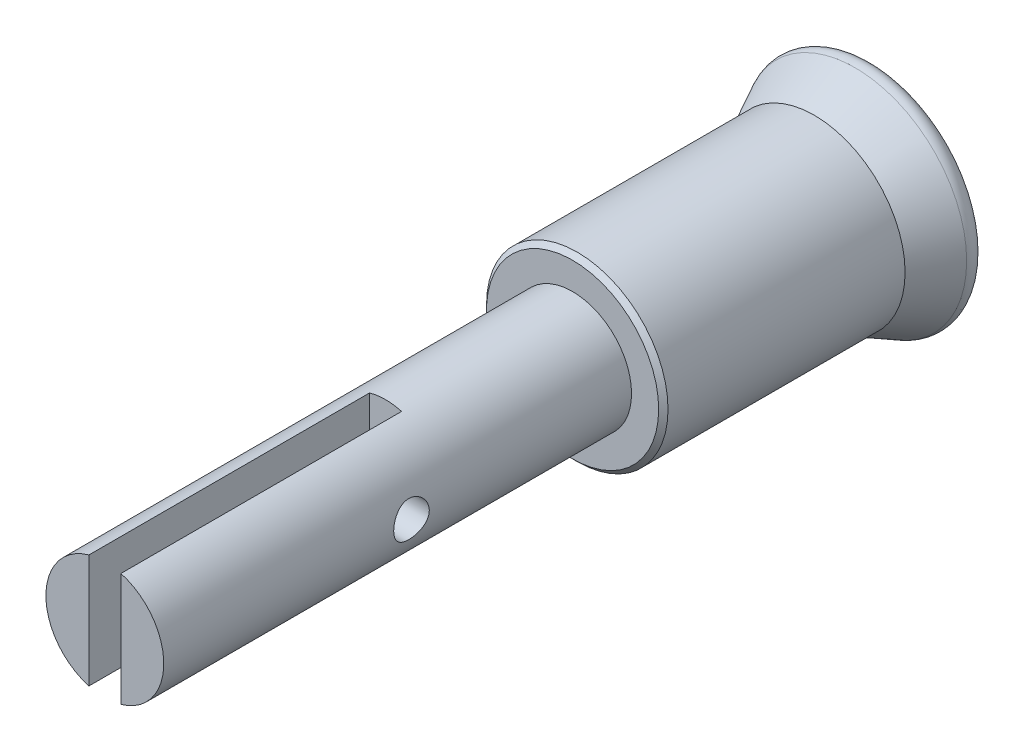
ISO-10303-21;
HEADER;
FILE_DESCRIPTION(('STEP AP214'),'2;1');
FILE_NAME('part.step','',(''),(''),'','','');
FILE_SCHEMA(('AUTOMOTIVE_DESIGN { 1 0 10303 214 1 1 1 1 }'));
ENDSEC;
DATA;
#1=APPLICATION_CONTEXT('core data for automotive mechanical design processes');
#2=APPLICATION_PROTOCOL_DEFINITION('international standard','automotive_design',2000,#1);
#3=PRODUCT_CONTEXT('',#1,'mechanical');
#4=PRODUCT('Part','Part','',(#3));
#5=PRODUCT_RELATED_PRODUCT_CATEGORY('part','',(#4));
#6=PRODUCT_DEFINITION_FORMATION('','',#4);
#7=PRODUCT_DEFINITION_CONTEXT('part definition',#1,'design');
#8=PRODUCT_DEFINITION('design','',#6,#7);
#9=PRODUCT_DEFINITION_SHAPE('','',#8);
#10=(LENGTH_UNIT() NAMED_UNIT(*) SI_UNIT(.MILLI.,.METRE.));
#11=(NAMED_UNIT(*) PLANE_ANGLE_UNIT() SI_UNIT($,.RADIAN.));
#12=(NAMED_UNIT(*) SI_UNIT($,.STERADIAN.) SOLID_ANGLE_UNIT());
#13=UNCERTAINTY_MEASURE_WITH_UNIT(LENGTH_MEASURE(1.E-05),#10,'distance_accuracy_value','');
#14=(GEOMETRIC_REPRESENTATION_CONTEXT(3) GLOBAL_UNCERTAINTY_ASSIGNED_CONTEXT((#13)) GLOBAL_UNIT_ASSIGNED_CONTEXT((#10,
#11,#12)) REPRESENTATION_CONTEXT('',''));
#15=CARTESIAN_POINT('',(0.,0.,0.));
#16=DIRECTION('',(0.,0.,1.));
#17=DIRECTION('',(1.,0.,0.));
#18=AXIS2_PLACEMENT_3D('',#15,#16,#17);
#19=CARTESIAN_POINT('',(0.,0.,20.32));
#20=DIRECTION('',(0.,0.,-1.));
#21=DIRECTION('',(-1.,0.,0.));
#22=AXIS2_PLACEMENT_3D('',#19,#20,#21);
#23=CONICAL_SURFACE('',#22,5.84199999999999,0.785398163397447);
#24=CARTESIAN_POINT('',(0.,0.,20.32));
#25=DIRECTION('',(0.,0.,1.));
#26=DIRECTION('',(1.,0.,0.));
#27=AXIS2_PLACEMENT_3D('',#24,#25,#26);
#28=CIRCLE('',#27,5.84199999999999);
#29=CARTESIAN_POINT('',(5.84199999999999,0.,20.32));
#30=VERTEX_POINT('',#29);
#31=EDGE_CURVE('E43',#30,#30,#28,.T.);
#32=ORIENTED_EDGE('',*,*,#31,.F.);
#33=EDGE_LOOP('',(#32));
#34=FACE_BOUND('',#33,.T.);
#35=CARTESIAN_POINT('',(0.,0.,20.0025));
#36=DIRECTION('',(0.,0.,-1.));
#37=DIRECTION('',(-1.,0.,0.));
#38=AXIS2_PLACEMENT_3D('',#35,#36,#37);
#39=CIRCLE('',#38,6.1595);
#40=CARTESIAN_POINT('',(6.1595,0.,20.0025));
#41=VERTEX_POINT('',#40);
#42=EDGE_CURVE('E112',#41,#41,#39,.F.);
#43=ORIENTED_EDGE('',*,*,#42,.T.);
#44=EDGE_LOOP('',(#43));
#45=FACE_BOUND('',#44,.T.);
#46=ADVANCED_FACE('F36',(#34,#45),#23,.T.);
#47=CARTESIAN_POINT('',(0.,0.,52.07));
#48=DIRECTION('',(0.,0.,1.));
#49=DIRECTION('',(1.,0.,0.));
#50=AXIS2_PLACEMENT_3D('',#47,#48,#49);
#51=PLANE('',#50);
#52=DIRECTION('',(0.,1.,0.));
#53=VECTOR('',#52,1.);
#54=CARTESIAN_POINT('',(1.0922,0.,52.07));
#55=LINE('',#54,#53);
#56=CARTESIAN_POINT('',(1.0922,-3.84851911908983,52.07));
#57=VERTEX_POINT('',#56);
#58=CARTESIAN_POINT('',(1.0922,3.84851911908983,52.07));
#59=VERTEX_POINT('',#58);
#60=EDGE_CURVE('E83',#57,#59,#55,.T.);
#61=ORIENTED_EDGE('',*,*,#60,.F.);
#62=CARTESIAN_POINT('',(0.,0.,52.07));
#63=DIRECTION('',(0.,0.,1.));
#64=DIRECTION('',(1.,0.,0.));
#65=AXIS2_PLACEMENT_3D('',#62,#63,#64);
#66=CIRCLE('',#65,4.0005);
#67=EDGE_CURVE('E96',#57,#59,#66,.T.);
#68=ORIENTED_EDGE('',*,*,#67,.T.);
#69=EDGE_LOOP('',(#61,#68));
#70=FACE_BOUND('',#69,.T.);
#71=ADVANCED_FACE('F158',(#70),#51,.T.);
#72=CARTESIAN_POINT('',(0.,0.,20.32));
#73=DIRECTION('',(0.,0.,1.));
#74=DIRECTION('',(1.,0.,0.));
#75=AXIS2_PLACEMENT_3D('',#72,#73,#74);
#76=PLANE('',#75);
#77=ORIENTED_EDGE('',*,*,#31,.T.);
#78=EDGE_LOOP('',(#77));
#79=FACE_BOUND('',#78,.T.);
#80=CARTESIAN_POINT('',(0.,0.,20.32));
#81=DIRECTION('',(0.,0.,1.));
#82=DIRECTION('',(1.,0.,0.));
#83=AXIS2_PLACEMENT_3D('',#80,#81,#82);
#84=CIRCLE('',#83,4.0005);
#85=CARTESIAN_POINT('',(4.0005,0.,20.32));
#86=VERTEX_POINT('',#85);
#87=EDGE_CURVE('E99',#86,#86,#84,.T.);
#88=ORIENTED_EDGE('',*,*,#87,.F.);
#89=EDGE_LOOP('',(#88));
#90=FACE_BOUND('',#89,.T.);
#91=ADVANCED_FACE('F162',(#79,#90),#76,.T.);
#92=CARTESIAN_POINT('',(0.,0.,52.07));
#93=DIRECTION('',(0.,0.,-1.));
#94=DIRECTION('',(-1.,0.,0.));
#95=AXIS2_PLACEMENT_3D('',#92,#93,#94);
#96=CYLINDRICAL_SURFACE('',#95,4.0005);
#97=CARTESIAN_POINT('',(-4.0005,0.,36.4620643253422));
#98=CARTESIAN_POINT('',(-4.00049945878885,-0.0661712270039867,36.4620635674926));
#99=CARTESIAN_POINT('',(-3.99884254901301,-0.13235012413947,36.4566024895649));
#100=CARTESIAN_POINT('',(-3.99239474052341,-0.262779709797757,36.4349549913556));
#101=CARTESIAN_POINT('',(-3.98760293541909,-0.327029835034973,36.4187654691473));
#102=CARTESIAN_POINT('',(-3.97541018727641,-0.451701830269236,36.3762515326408));
#103=CARTESIAN_POINT('',(-3.96801311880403,-0.512129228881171,36.3499421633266));
#104=CARTESIAN_POINT('',(-3.95137804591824,-0.627714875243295,36.2879973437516));
#105=CARTESIAN_POINT('',(-3.94213979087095,-0.68287240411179,36.2523606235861));
#106=CARTESIAN_POINT('',(-3.92250773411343,-0.787951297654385,36.1716845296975));
#107=CARTESIAN_POINT('',(-3.912090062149,-0.837698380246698,36.1264239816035));
#108=CARTESIAN_POINT('',(-3.89141518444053,-0.929023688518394,36.0282563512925));
#109=CARTESIAN_POINT('',(-3.88115800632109,-0.970600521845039,35.975347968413));
#110=CARTESIAN_POINT('',(-3.86171247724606,-1.04532572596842,35.8619076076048));
#111=CARTESIAN_POINT('',(-3.8525537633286,-1.07826074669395,35.8012295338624));
#112=CARTESIAN_POINT('',(-3.83669918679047,-1.1333879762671,35.6748752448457));
#113=CARTESIAN_POINT('',(-3.83000272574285,-1.15558279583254,35.609200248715));
#114=CARTESIAN_POINT('',(-3.82007972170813,-1.18796998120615,35.4766746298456));
#115=CARTESIAN_POINT('',(-3.81676044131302,-1.19848389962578,35.4099097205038));
#116=CARTESIAN_POINT('',(-3.8136918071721,-1.20821497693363,35.2754874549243));
#117=CARTESIAN_POINT('',(-3.81394157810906,-1.20743490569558,35.2078303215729));
#118=CARTESIAN_POINT('',(-3.8179006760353,-1.19485257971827,35.0761646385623));
#119=CARTESIAN_POINT('',(-3.82148332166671,-1.18345391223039,35.0121130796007));
#120=CARTESIAN_POINT('',(-3.83149944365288,-1.1506103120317,34.8868773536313));
#121=CARTESIAN_POINT('',(-3.83793320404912,-1.1291643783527,34.825693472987));
#122=CARTESIAN_POINT('',(-3.85302722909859,-1.07653928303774,34.7069459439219));
#123=CARTESIAN_POINT('',(-3.861717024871,-1.04522975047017,34.6494439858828));
#124=CARTESIAN_POINT('',(-3.88032988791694,-0.973856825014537,34.5403753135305));
#125=CARTESIAN_POINT('',(-3.89025325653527,-0.933791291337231,34.4888100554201));
#126=CARTESIAN_POINT('',(-3.910728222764,-0.844042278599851,34.3907903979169));
#127=CARTESIAN_POINT('',(-3.92128865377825,-0.794024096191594,34.3446437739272));
#128=CARTESIAN_POINT('',(-3.94147673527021,-0.686827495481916,34.2613214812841));
#129=CARTESIAN_POINT('',(-3.95110432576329,-0.629648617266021,34.2241463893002));
#130=CARTESIAN_POINT('',(-3.96843148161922,-0.509190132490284,34.1596328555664));
#131=CARTESIAN_POINT('',(-3.97611742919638,-0.445871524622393,34.1323633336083));
#132=CARTESIAN_POINT('',(-3.98859714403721,-0.315261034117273,34.0889517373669));
#133=CARTESIAN_POINT('',(-3.99339172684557,-0.247970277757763,34.0728065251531));
#134=CARTESIAN_POINT('',(-3.99941922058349,-0.113941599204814,34.0526157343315));
#135=CARTESIAN_POINT('',(-4.00077484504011,-0.0472719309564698,34.0481530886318));
#136=CARTESIAN_POINT('',(-4.00013206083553,0.085868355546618,34.0502842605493));
#137=CARTESIAN_POINT('',(-3.99813410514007,0.152338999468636,34.0568765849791));
#138=CARTESIAN_POINT('',(-3.99108902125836,0.281615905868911,34.0805936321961));
#139=CARTESIAN_POINT('',(-3.9861126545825,0.344471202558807,34.0974740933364));
#140=CARTESIAN_POINT('',(-3.97368751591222,0.466443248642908,34.1409938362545));
#141=CARTESIAN_POINT('',(-3.96623844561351,0.525559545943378,34.1676342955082));
#142=CARTESIAN_POINT('',(-3.94942284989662,0.639905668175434,34.2306143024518));
#143=CARTESIAN_POINT('',(-3.94001569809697,0.695012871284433,34.2671653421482));
#144=CARTESIAN_POINT('',(-3.92036341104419,0.798453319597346,34.348672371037));
#145=CARTESIAN_POINT('',(-3.9101180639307,0.846784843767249,34.393630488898));
#146=CARTESIAN_POINT('',(-3.88947222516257,0.937142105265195,34.4926352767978));
#147=CARTESIAN_POINT('',(-3.87907985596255,0.978871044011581,34.5469551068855));
#148=CARTESIAN_POINT('',(-3.85971542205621,1.05264283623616,34.6620520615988));
#149=CARTESIAN_POINT('',(-3.85074332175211,1.0846859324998,34.7228290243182));
#150=CARTESIAN_POINT('',(-3.83533814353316,1.13795949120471,34.8489293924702));
#151=CARTESIAN_POINT('',(-3.82889349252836,1.15923937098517,34.9142304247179));
#152=CARTESIAN_POINT('',(-3.81931078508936,1.19043557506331,35.0477200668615));
#153=CARTESIAN_POINT('',(-3.81617158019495,1.20035584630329,35.1159076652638));
#154=CARTESIAN_POINT('',(-3.81366916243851,1.20828098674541,35.2501491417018));
#155=CARTESIAN_POINT('',(-3.81415249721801,1.20677006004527,35.3161719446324));
#156=CARTESIAN_POINT('',(-3.81847127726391,1.19303312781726,35.4469758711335));
#157=CARTESIAN_POINT('',(-3.8223065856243,1.18080755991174,35.5117570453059));
#158=CARTESIAN_POINT('',(-3.83279369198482,1.14630243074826,35.6374380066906));
#159=CARTESIAN_POINT('',(-3.83940914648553,1.12415236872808,35.6983766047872));
#160=CARTESIAN_POINT('',(-3.85470413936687,1.07052796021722,35.815721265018));
#161=CARTESIAN_POINT('',(-3.86338407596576,1.03905181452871,35.8721264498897));
#162=CARTESIAN_POINT('',(-3.88222833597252,0.966313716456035,35.9810467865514));
#163=CARTESIAN_POINT('',(-3.89243550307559,0.924734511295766,36.033342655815));
#164=CARTESIAN_POINT('',(-3.91297747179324,0.833540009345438,36.130371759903));
#165=CARTESIAN_POINT('',(-3.92331230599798,0.783922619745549,36.1751030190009));
#166=CARTESIAN_POINT('',(-3.94331259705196,0.676288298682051,36.2570558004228));
#167=CARTESIAN_POINT('',(-3.95294911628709,0.618065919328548,36.2940152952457));
#168=CARTESIAN_POINT('',(-3.97011752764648,0.495943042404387,36.3575696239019));
#169=CARTESIAN_POINT('',(-3.97765038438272,0.43204516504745,36.384169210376));
#170=CARTESIAN_POINT('',(-3.9891216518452,0.307272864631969,36.4239203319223));
#171=CARTESIAN_POINT('',(-3.99335305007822,0.246778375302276,36.4381852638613));
#172=CARTESIAN_POINT('',(-3.99904224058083,0.124191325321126,36.4572568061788));
#173=CARTESIAN_POINT('',(-4.00050050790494,0.0620990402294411,36.4620650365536));
#174=CARTESIAN_POINT('',(-4.0005,0.,36.4620643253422));
#175=B_SPLINE_CURVE_WITH_KNOTS('',3,(#97,#98,#99,#100,#101,#102,#103,#104,#105,#106,#107,#108,
#109,#110,#111,#112,#113,#114,#115,#116,#117,#118,#119,#120,#121,#122,#123,#124,#125,#126,#127,
#128,#129,#130,#131,#132,#133,#134,#135,#136,#137,#138,#139,#140,#141,#142,#143,#144,#145,#146,
#147,#148,#149,#150,#151,#152,#153,#154,#155,#156,#157,#158,#159,#160,#161,#162,#163,#164,#165,
#166,#167,#168,#169,#170,#171,#172,#173,#174),.UNSPECIFIED.,.T.,.F.,(4,2,2,2,2,2,2,2,2,2,2,2,2,
2,2,2,2,2,2,2,2,2,2,2,2,2,2,2,2,2,2,2,2,2,2,2,2,2,4),(0.,0.198285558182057,0.396628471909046,
0.594677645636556,0.792753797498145,0.996000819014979,1.19928244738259,1.40719038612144,
1.61504776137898,1.81702937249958,2.01896144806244,2.21351865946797,2.40809525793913,
2.6053599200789,2.80267286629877,3.00831799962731,3.21397634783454,3.42103936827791,
3.6280439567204,3.82755085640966,4.02703081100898,4.22194980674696,4.41689232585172,
4.61637622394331,4.81591069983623,5.02277373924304,5.22963159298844,5.43553087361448,
5.64135859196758,5.83851820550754,6.03566976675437,6.23032051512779,6.42500884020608,
6.62685547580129,6.82875474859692,7.03664112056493,7.24443201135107,7.4305469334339,
7.6166299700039),.UNSPECIFIED.);
#176=CARTESIAN_POINT('',(-4.0005,0.,36.4620643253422));
#177=VERTEX_POINT('',#176);
#178=EDGE_CURVE('E119',#177,#177,#175,.T.);
#179=ORIENTED_EDGE('',*,*,#178,.T.);
#180=EDGE_LOOP('',(#179));
#181=FACE_BOUND('',#180,.T.);
#182=CARTESIAN_POINT('',(4.0005,0.,34.0490643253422));
#183=CARTESIAN_POINT('',(4.00049945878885,-0.0661712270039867,34.0490650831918));
#184=CARTESIAN_POINT('',(3.99884254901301,-0.13235012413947,34.0545261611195));
#185=CARTESIAN_POINT('',(3.99239474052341,-0.262779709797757,34.0761736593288));
#186=CARTESIAN_POINT('',(3.98760293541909,-0.327029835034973,34.0923631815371));
#187=CARTESIAN_POINT('',(3.97541018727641,-0.451701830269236,34.1348771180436));
#188=CARTESIAN_POINT('',(3.96801311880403,-0.512129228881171,34.1611864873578));
#189=CARTESIAN_POINT('',(3.95137804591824,-0.627714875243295,34.2231313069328));
#190=CARTESIAN_POINT('',(3.94213979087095,-0.68287240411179,34.2587680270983));
#191=CARTESIAN_POINT('',(3.92250773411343,-0.78795129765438,34.3394441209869));
#192=CARTESIAN_POINT('',(3.912090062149,-0.837698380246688,34.3847046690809));
#193=CARTESIAN_POINT('',(3.89141518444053,-0.929023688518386,34.4828722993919));
#194=CARTESIAN_POINT('',(3.88115800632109,-0.970600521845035,34.5357806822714));
#195=CARTESIAN_POINT('',(3.86171247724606,-1.04532572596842,34.6492210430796));
#196=CARTESIAN_POINT('',(3.8525537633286,-1.07826074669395,34.709899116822));
#197=CARTESIAN_POINT('',(3.83669918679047,-1.1333879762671,34.8362534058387));
#198=CARTESIAN_POINT('',(3.83000272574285,-1.15558279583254,34.9019284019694));
#199=CARTESIAN_POINT('',(3.82007972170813,-1.18796998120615,35.0344540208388));
#200=CARTESIAN_POINT('',(3.81676044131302,-1.19848389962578,35.1012189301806));
#201=CARTESIAN_POINT('',(3.8136918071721,-1.20821497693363,35.2356411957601));
#202=CARTESIAN_POINT('',(3.81394157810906,-1.20743490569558,35.3032983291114));
#203=CARTESIAN_POINT('',(3.8179006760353,-1.19485257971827,35.4349640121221));
#204=CARTESIAN_POINT('',(3.82148332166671,-1.18345391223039,35.4990155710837));
#205=CARTESIAN_POINT('',(3.83149944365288,-1.1506103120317,35.6242512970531));
#206=CARTESIAN_POINT('',(3.83793320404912,-1.1291643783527,35.6854351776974));
#207=CARTESIAN_POINT('',(3.85302722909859,-1.07653928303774,35.8041827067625));
#208=CARTESIAN_POINT('',(3.861717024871,-1.04522975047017,35.8616846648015));
#209=CARTESIAN_POINT('',(3.88032988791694,-0.973856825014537,35.9707533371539));
#210=CARTESIAN_POINT('',(3.89025325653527,-0.933791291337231,36.0223185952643));
#211=CARTESIAN_POINT('',(3.910728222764,-0.844042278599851,36.1203382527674));
#212=CARTESIAN_POINT('',(3.92128865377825,-0.794024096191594,36.1664848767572));
#213=CARTESIAN_POINT('',(3.94147673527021,-0.686827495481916,36.2498071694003));
#214=CARTESIAN_POINT('',(3.95110432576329,-0.629648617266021,36.2869822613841));
#215=CARTESIAN_POINT('',(3.96843148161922,-0.509190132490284,36.351495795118));
#216=CARTESIAN_POINT('',(3.97611742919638,-0.445871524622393,36.3787653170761));
#217=CARTESIAN_POINT('',(3.98859714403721,-0.315261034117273,36.4221769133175));
#218=CARTESIAN_POINT('',(3.99339172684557,-0.247970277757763,36.4383221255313));
#219=CARTESIAN_POINT('',(3.99941922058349,-0.113941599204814,36.4585129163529));
#220=CARTESIAN_POINT('',(4.00077484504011,-0.0472719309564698,36.4629755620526));
#221=CARTESIAN_POINT('',(4.00013206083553,0.085868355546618,36.4608443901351));
#222=CARTESIAN_POINT('',(3.99813410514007,0.152338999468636,36.4542520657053));
#223=CARTESIAN_POINT('',(3.99108902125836,0.281615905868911,36.4305350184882));
#224=CARTESIAN_POINT('',(3.9861126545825,0.344471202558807,36.413654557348));
#225=CARTESIAN_POINT('',(3.97368751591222,0.466443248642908,36.3701348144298));
#226=CARTESIAN_POINT('',(3.96623844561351,0.525559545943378,36.3434943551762));
#227=CARTESIAN_POINT('',(3.94942284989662,0.639905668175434,36.2805143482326));
#228=CARTESIAN_POINT('',(3.94001569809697,0.695012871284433,36.2439633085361));
#229=CARTESIAN_POINT('',(3.92036341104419,0.798453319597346,36.1624562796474));
#230=CARTESIAN_POINT('',(3.9101180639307,0.846784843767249,36.1174981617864));
#231=CARTESIAN_POINT('',(3.88947222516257,0.937142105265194,36.0184933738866));
#232=CARTESIAN_POINT('',(3.87907985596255,0.978871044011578,35.9641735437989));
#233=CARTESIAN_POINT('',(3.85971542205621,1.05264283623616,35.8490765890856));
#234=CARTESIAN_POINT('',(3.85074332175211,1.0846859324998,35.7882996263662));
#235=CARTESIAN_POINT('',(3.83533814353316,1.13795949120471,35.6621992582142));
#236=CARTESIAN_POINT('',(3.82889349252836,1.15923937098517,35.5968982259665));
#237=CARTESIAN_POINT('',(3.81931078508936,1.19043557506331,35.4634085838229));
#238=CARTESIAN_POINT('',(3.81617158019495,1.20035584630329,35.3952209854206));
#239=CARTESIAN_POINT('',(3.81366916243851,1.20828098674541,35.2609795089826));
#240=CARTESIAN_POINT('',(3.81415249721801,1.20677006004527,35.194956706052));
#241=CARTESIAN_POINT('',(3.81847127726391,1.19303312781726,35.0641527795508));
#242=CARTESIAN_POINT('',(3.8223065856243,1.18080755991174,34.9993716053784));
#243=CARTESIAN_POINT('',(3.83279369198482,1.14630243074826,34.8736906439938));
#244=CARTESIAN_POINT('',(3.83940914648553,1.12415236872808,34.8127520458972));
#245=CARTESIAN_POINT('',(3.85470413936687,1.07052796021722,34.6954073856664));
#246=CARTESIAN_POINT('',(3.86338407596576,1.03905181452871,34.6390022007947));
#247=CARTESIAN_POINT('',(3.88222833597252,0.966313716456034,34.530081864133));
#248=CARTESIAN_POINT('',(3.89243550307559,0.924734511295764,34.4777859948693));
#249=CARTESIAN_POINT('',(3.91297747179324,0.833540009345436,34.3807568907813));
#250=CARTESIAN_POINT('',(3.92331230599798,0.783922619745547,34.3360256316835));
#251=CARTESIAN_POINT('',(3.94331259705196,0.676288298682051,34.2540728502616));
#252=CARTESIAN_POINT('',(3.95294911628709,0.618065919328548,34.2171133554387));
#253=CARTESIAN_POINT('',(3.97011752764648,0.495943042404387,34.1535590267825));
#254=CARTESIAN_POINT('',(3.97765038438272,0.43204516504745,34.1269594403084));
#255=CARTESIAN_POINT('',(3.9891216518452,0.307272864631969,34.0872083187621));
#256=CARTESIAN_POINT('',(3.99335305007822,0.246778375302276,34.072943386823));
#257=CARTESIAN_POINT('',(3.99904224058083,0.124191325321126,34.0538718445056));
#258=CARTESIAN_POINT('',(4.00050050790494,0.0620990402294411,34.0490636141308));
#259=CARTESIAN_POINT('',(4.0005,0.,34.0490643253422));
#260=B_SPLINE_CURVE_WITH_KNOTS('',3,(#182,#183,#184,#185,#186,#187,#188,#189,#190,#191,#192,
#193,#194,#195,#196,#197,#198,#199,#200,#201,#202,#203,#204,#205,#206,#207,#208,#209,#210,#211,
#212,#213,#214,#215,#216,#217,#218,#219,#220,#221,#222,#223,#224,#225,#226,#227,#228,#229,#230,
#231,#232,#233,#234,#235,#236,#237,#238,#239,#240,#241,#242,#243,#244,#245,#246,#247,#248,#249,
#250,#251,#252,#253,#254,#255,#256,#257,#258,#259),.UNSPECIFIED.,.T.,.F.,(4,2,2,2,2,2,2,2,2,2,2,
2,2,2,2,2,2,2,2,2,2,2,2,2,2,2,2,2,2,2,2,2,2,2,2,2,2,2,4),(0.,0.198285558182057,
0.396628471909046,0.594677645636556,0.792753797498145,0.99600081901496,1.19928244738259,
1.40719038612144,1.61504776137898,1.81702937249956,2.01896144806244,2.21351865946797,
2.40809525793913,2.6053599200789,2.80267286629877,3.00831799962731,3.21397634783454,
3.42103936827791,3.6280439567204,3.82755085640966,4.02703081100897,4.22194980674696,
4.41689232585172,4.61637622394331,4.81591069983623,5.02277373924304,5.22963159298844,
5.43553087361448,5.64135859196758,5.83851820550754,6.03566976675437,6.23032051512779,
6.42500884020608,6.6268554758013,6.82875474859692,7.03664112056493,7.24443201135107,
7.4305469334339,7.6166299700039),.UNSPECIFIED.);
#261=CARTESIAN_POINT('',(4.0005,0.,34.0490643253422));
#262=VERTEX_POINT('',#261);
#263=EDGE_CURVE('E131',#262,#262,#260,.T.);
#264=ORIENTED_EDGE('',*,*,#263,.T.);
#265=EDGE_LOOP('',(#264));
#266=FACE_BOUND('',#265,.T.);
#267=CARTESIAN_POINT('',(0.,0.,33.02));
#268=DIRECTION('',(0.,0.,1.));
#269=DIRECTION('',(1.,0.,0.));
#270=AXIS2_PLACEMENT_3D('',#267,#268,#269);
#271=CIRCLE('',#270,4.0005);
#272=CARTESIAN_POINT('',(1.0922,3.84851911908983,33.02));
#273=VERTEX_POINT('',#272);
#274=CARTESIAN_POINT('',(-1.0795,3.85210072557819,33.02));
#275=VERTEX_POINT('',#274);
#276=EDGE_CURVE('E108',#273,#275,#271,.T.);
#277=ORIENTED_EDGE('',*,*,#276,.F.);
#278=DIRECTION('',(0.,0.,-1.));
#279=VECTOR('',#278,1.);
#280=CARTESIAN_POINT('',(1.0922,3.84851911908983,52.07));
#281=LINE('',#280,#279);
#282=EDGE_CURVE('E58',#273,#59,#281,.F.);
#283=ORIENTED_EDGE('',*,*,#282,.T.);
#284=ORIENTED_EDGE('',*,*,#67,.F.);
#285=DIRECTION('',(0.,0.,-1.));
#286=VECTOR('',#285,1.);
#287=CARTESIAN_POINT('',(1.0922,-3.84851911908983,52.07));
#288=LINE('',#287,#286);
#289=CARTESIAN_POINT('',(1.0922,-3.84851911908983,33.02));
#290=VERTEX_POINT('',#289);
#291=EDGE_CURVE('E102',#57,#290,#288,.T.);
#292=ORIENTED_EDGE('',*,*,#291,.T.);
#293=CARTESIAN_POINT('',(-1.0795,-3.85210072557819,33.02));
#294=VERTEX_POINT('',#293);
#295=EDGE_CURVE('E92',#294,#290,#271,.T.);
#296=ORIENTED_EDGE('',*,*,#295,.F.);
#297=DIRECTION('',(0.,0.,-1.));
#298=VECTOR('',#297,1.);
#299=CARTESIAN_POINT('',(-1.0795,-3.85210072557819,52.07));
#300=LINE('',#299,#298);
#301=CARTESIAN_POINT('',(-1.0795,-3.85210072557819,52.07));
#302=VERTEX_POINT('',#301);
#303=EDGE_CURVE('E78',#294,#302,#300,.F.);
#304=ORIENTED_EDGE('',*,*,#303,.T.);
#305=CARTESIAN_POINT('',(-1.0795,3.85210072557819,52.07));
#306=VERTEX_POINT('',#305);
#307=EDGE_CURVE('E84',#306,#302,#66,.T.);
#308=ORIENTED_EDGE('',*,*,#307,.F.);
#309=DIRECTION('',(0.,0.,-1.));
#310=VECTOR('',#309,1.);
#311=CARTESIAN_POINT('',(-1.0795,3.85210072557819,52.07));
#312=LINE('',#311,#310);
#313=EDGE_CURVE('E50',#306,#275,#312,.T.);
#314=ORIENTED_EDGE('',*,*,#313,.T.);
#315=EDGE_LOOP('',(#277,#283,#284,#292,#296,#304,#308,#314));
#316=FACE_BOUND('',#315,.T.);
#317=ORIENTED_EDGE('',*,*,#87,.T.);
#318=EDGE_LOOP('',(#317));
#319=FACE_BOUND('',#318,.T.);
#320=ADVANCED_FACE('F89',(#181,#266,#316,#319),#96,.T.);
#321=DIRECTION('',(0.,-1.,0.));
#322=VECTOR('',#321,1.);
#323=CARTESIAN_POINT('',(-1.0795,0.,52.07));
#324=LINE('',#323,#322);
#325=EDGE_CURVE('E75',#306,#302,#324,.T.);
#326=ORIENTED_EDGE('',*,*,#325,.F.);
#327=ORIENTED_EDGE('',*,*,#307,.T.);
#328=EDGE_LOOP('',(#326,#327));
#329=FACE_BOUND('',#328,.T.);
#330=ADVANCED_FACE('F95',(#329),#51,.T.);
#331=CARTESIAN_POINT('',(0.,0.,33.02));
#332=DIRECTION('',(0.,0.,1.));
#333=DIRECTION('',(1.,0.,0.));
#334=AXIS2_PLACEMENT_3D('',#331,#332,#333);
#335=PLANE('',#334);
#336=ORIENTED_EDGE('',*,*,#276,.T.);
#337=DIRECTION('',(0.,-1.,0.));
#338=VECTOR('',#337,1.);
#339=CARTESIAN_POINT('',(-1.0795,4.39104118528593,33.02));
#340=LINE('',#339,#338);
#341=EDGE_CURVE('E118',#275,#294,#340,.T.);
#342=ORIENTED_EDGE('',*,*,#341,.T.);
#343=ORIENTED_EDGE('',*,*,#295,.T.);
#344=DIRECTION('',(0.,1.,0.));
#345=VECTOR('',#344,1.);
#346=CARTESIAN_POINT('',(1.0922,4.38789950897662,33.02));
#347=LINE('',#346,#345);
#348=EDGE_CURVE('E93',#290,#273,#347,.T.);
#349=ORIENTED_EDGE('',*,*,#348,.T.);
#350=EDGE_LOOP('',(#336,#342,#343,#349));
#351=FACE_BOUND('',#350,.T.);
#352=ADVANCED_FACE('F117',(#351),#335,.T.);
#353=CARTESIAN_POINT('',(1.0922,4.38789950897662,33.02));
#354=DIRECTION('',(1.,0.,0.));
#355=DIRECTION('',(0.,1.,0.));
#356=AXIS2_PLACEMENT_3D('',#353,#354,#355);
#357=PLANE('',#356);
#358=CARTESIAN_POINT('',(1.0922,0.,35.2555643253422));
#359=DIRECTION('',(1.,0.,0.));
#360=DIRECTION('',(0.,1.,0.));
#361=AXIS2_PLACEMENT_3D('',#358,#359,#360);
#362=CIRCLE('',#361,1.2065);
#363=CARTESIAN_POINT('',(1.0922,1.2065,35.2555643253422));
#364=VERTEX_POINT('',#363);
#365=EDGE_CURVE('E111',#364,#364,#362,.T.);
#366=ORIENTED_EDGE('',*,*,#365,.T.);
#367=EDGE_LOOP('',(#366));
#368=FACE_BOUND('',#367,.T.);
#369=ORIENTED_EDGE('',*,*,#60,.T.);
#370=ORIENTED_EDGE('',*,*,#282,.F.);
#371=ORIENTED_EDGE('',*,*,#348,.F.);
#372=ORIENTED_EDGE('',*,*,#291,.F.);
#373=EDGE_LOOP('',(#369,#370,#371,#372));
#374=FACE_BOUND('',#373,.T.);
#375=ADVANCED_FACE('F151',(#368,#374),#357,.F.);
#376=CARTESIAN_POINT('',(-1.0795,4.39104118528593,33.02));
#377=DIRECTION('',(-1.,0.,0.));
#378=DIRECTION('',(0.,-1.,0.));
#379=AXIS2_PLACEMENT_3D('',#376,#377,#378);
#380=PLANE('',#379);
#381=CARTESIAN_POINT('',(-1.0795,0.,35.2555643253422));
#382=DIRECTION('',(-1.,0.,0.));
#383=DIRECTION('',(0.,-1.,0.));
#384=AXIS2_PLACEMENT_3D('',#381,#382,#383);
#385=CIRCLE('',#384,1.2065);
#386=CARTESIAN_POINT('',(-1.0795,-1.2065,35.2555643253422));
#387=VERTEX_POINT('',#386);
#388=EDGE_CURVE('E109',#387,#387,#385,.T.);
#389=ORIENTED_EDGE('',*,*,#388,.T.);
#390=EDGE_LOOP('',(#389));
#391=FACE_BOUND('',#390,.T.);
#392=ORIENTED_EDGE('',*,*,#325,.T.);
#393=ORIENTED_EDGE('',*,*,#303,.F.);
#394=ORIENTED_EDGE('',*,*,#341,.F.);
#395=ORIENTED_EDGE('',*,*,#313,.F.);
#396=EDGE_LOOP('',(#392,#393,#394,#395));
#397=FACE_BOUND('',#396,.T.);
#398=ADVANCED_FACE('F77',(#391,#397),#380,.F.);
#399=CARTESIAN_POINT('',(-63.5,0.,35.2555643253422));
#400=DIRECTION('',(1.,0.,0.));
#401=DIRECTION('',(0.,0.,-1.));
#402=AXIS2_PLACEMENT_3D('',#399,#400,#401);
#403=CYLINDRICAL_SURFACE('',#402,1.2065);
#404=ORIENTED_EDGE('',*,*,#388,.F.);
#405=EDGE_LOOP('',(#404));
#406=FACE_BOUND('',#405,.T.);
#407=ORIENTED_EDGE('',*,*,#178,.F.);
#408=EDGE_LOOP('',(#407));
#409=FACE_BOUND('',#408,.T.);
#410=ADVANCED_FACE('F139',(#406,#409),#403,.F.);
#411=ORIENTED_EDGE('',*,*,#365,.F.);
#412=EDGE_LOOP('',(#411));
#413=FACE_BOUND('',#412,.T.);
#414=ORIENTED_EDGE('',*,*,#263,.F.);
#415=EDGE_LOOP('',(#414));
#416=FACE_BOUND('',#415,.T.);
#417=ADVANCED_FACE('F144',(#413,#416),#403,.F.);
#418=CARTESIAN_POINT('',(0.,0.,-10.16));
#419=DIRECTION('',(0.,0.,1.));
#420=DIRECTION('',(1.,0.,0.));
#421=AXIS2_PLACEMENT_3D('',#418,#419,#420);
#422=CYLINDRICAL_SURFACE('',#421,6.1595);
#423=CARTESIAN_POINT('',(0.,0.,3.9116));
#424=DIRECTION('',(0.,0.,-1.));
#425=DIRECTION('',(-1.,0.,0.));
#426=AXIS2_PLACEMENT_3D('',#423,#424,#425);
#427=CIRCLE('',#426,6.1595);
#428=CARTESIAN_POINT('',(6.1595,0.,3.9116));
#429=VERTEX_POINT('',#428);
#430=EDGE_CURVE('E11',#429,#429,#427,.T.);
#431=CARTESIAN_POINT('',(6.1595,0.,3.9116));
#432=CARTESIAN_POINT('',(6.1595,0.,4.07921354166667));
#433=CARTESIAN_POINT('',(6.1595,0.,4.24682708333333));
#434=CARTESIAN_POINT('',(6.1595,0.,4.58205416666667));
#435=CARTESIAN_POINT('',(6.1595,0.,4.74966770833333));
#436=CARTESIAN_POINT('',(6.1595,0.,5.08489479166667));
#437=CARTESIAN_POINT('',(6.1595,0.,5.25250833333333));
#438=CARTESIAN_POINT('',(6.1595,0.,5.58773541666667));
#439=CARTESIAN_POINT('',(6.1595,0.,5.75534895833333));
#440=CARTESIAN_POINT('',(6.1595,0.,6.09057604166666));
#441=CARTESIAN_POINT('',(6.1595,0.,6.25818958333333));
#442=CARTESIAN_POINT('',(6.1595,0.,6.59341666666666));
#443=CARTESIAN_POINT('',(6.1595,0.,6.76103020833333));
#444=CARTESIAN_POINT('',(6.1595,0.,7.09625729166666));
#445=CARTESIAN_POINT('',(6.1595,0.,7.26387083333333));
#446=CARTESIAN_POINT('',(6.1595,0.,7.59909791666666));
#447=CARTESIAN_POINT('',(6.1595,0.,7.76671145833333));
#448=CARTESIAN_POINT('',(6.1595,0.,8.10193854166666));
#449=CARTESIAN_POINT('',(6.1595,0.,8.26955208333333));
#450=CARTESIAN_POINT('',(6.1595,0.,8.60477916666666));
#451=CARTESIAN_POINT('',(6.1595,0.,8.77239270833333));
#452=CARTESIAN_POINT('',(6.1595,0.,9.10761979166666));
#453=CARTESIAN_POINT('',(6.1595,0.,9.27523333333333));
#454=CARTESIAN_POINT('',(6.1595,0.,9.61046041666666));
#455=CARTESIAN_POINT('',(6.1595,0.,9.77807395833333));
#456=CARTESIAN_POINT('',(6.1595,0.,10.1133010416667));
#457=CARTESIAN_POINT('',(6.1595,0.,10.2809145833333));
#458=CARTESIAN_POINT('',(6.1595,0.,10.6161416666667));
#459=CARTESIAN_POINT('',(6.1595,0.,10.7837552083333));
#460=CARTESIAN_POINT('',(6.1595,0.,11.1189822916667));
#461=CARTESIAN_POINT('',(6.1595,0.,11.2865958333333));
#462=CARTESIAN_POINT('',(6.1595,0.,11.6218229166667));
#463=CARTESIAN_POINT('',(6.1595,0.,11.7894364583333));
#464=CARTESIAN_POINT('',(6.1595,0.,12.1246635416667));
#465=CARTESIAN_POINT('',(6.1595,0.,12.2922770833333));
#466=CARTESIAN_POINT('',(6.1595,0.,12.6275041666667));
#467=CARTESIAN_POINT('',(6.1595,0.,12.7951177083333));
#468=CARTESIAN_POINT('',(6.1595,0.,13.1303447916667));
#469=CARTESIAN_POINT('',(6.1595,0.,13.2979583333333));
#470=CARTESIAN_POINT('',(6.1595,0.,13.6331854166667));
#471=CARTESIAN_POINT('',(6.1595,0.,13.8007989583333));
#472=CARTESIAN_POINT('',(6.1595,0.,14.1360260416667));
#473=CARTESIAN_POINT('',(6.1595,0.,14.3036395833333));
#474=CARTESIAN_POINT('',(6.1595,0.,14.6388666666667));
#475=CARTESIAN_POINT('',(6.1595,0.,14.8064802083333));
#476=CARTESIAN_POINT('',(6.1595,0.,15.1417072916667));
#477=CARTESIAN_POINT('',(6.1595,0.,15.3093208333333));
#478=CARTESIAN_POINT('',(6.1595,0.,15.6445479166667));
#479=CARTESIAN_POINT('',(6.1595,0.,15.8121614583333));
#480=CARTESIAN_POINT('',(6.1595,0.,16.1473885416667));
#481=CARTESIAN_POINT('',(6.1595,0.,16.3150020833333));
#482=CARTESIAN_POINT('',(6.1595,0.,16.6502291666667));
#483=CARTESIAN_POINT('',(6.1595,0.,16.8178427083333));
#484=CARTESIAN_POINT('',(6.1595,0.,17.1530697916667));
#485=CARTESIAN_POINT('',(6.1595,0.,17.3206833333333));
#486=CARTESIAN_POINT('',(6.1595,0.,17.6559104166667));
#487=CARTESIAN_POINT('',(6.1595,0.,17.8235239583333));
#488=CARTESIAN_POINT('',(6.1595,0.,18.1587510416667));
#489=CARTESIAN_POINT('',(6.1595,0.,18.3263645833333));
#490=CARTESIAN_POINT('',(6.1595,0.,18.6615916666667));
#491=CARTESIAN_POINT('',(6.1595,0.,18.8292052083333));
#492=CARTESIAN_POINT('',(6.1595,0.,19.1644322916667));
#493=CARTESIAN_POINT('',(6.1595,0.,19.3320458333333));
#494=CARTESIAN_POINT('',(6.1595,0.,19.6672729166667));
#495=CARTESIAN_POINT('',(6.1595,0.,19.8348864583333));
#496=CARTESIAN_POINT('',(6.1595,0.,20.0025));
#497=B_SPLINE_CURVE_WITH_KNOTS('',3,(#431,#432,#433,#434,#435,#436,#437,#438,#439,#440,#441,
#442,#443,#444,#445,#446,#447,#448,#449,#450,#451,#452,#453,#454,#455,#456,#457,#458,#459,#460,
#461,#462,#463,#464,#465,#466,#467,#468,#469,#470,#471,#472,#473,#474,#475,#476,#477,#478,#479,
#480,#481,#482,#483,#484,#485,#486,#487,#488,#489,#490,#491,#492,#493,#494,#495,#496),
.UNSPECIFIED.,.F.,.F.,(4,2,2,2,2,2,2,2,2,2,2,2,2,2,2,2,2,2,2,2,2,2,2,2,2,2,2,2,2,2,2,2,4),(0.,
0.502840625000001,1.00568125,1.508521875,2.0113625,2.514203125,3.01704375,3.519884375,4.022725,
4.525565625,5.02840625,5.53124687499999,6.03408749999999,6.536928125,7.03976875,7.542609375,
8.04545,8.548290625,9.05113125,9.55397187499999,10.0568125,10.559653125,11.06249375,
11.565334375,12.068175,12.571015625,13.07385625,13.576696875,14.0795375,14.582378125,
15.08521875,15.588059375,16.0909),.UNSPECIFIED.);
#498=EDGE_CURVE('BSEAM146',#429,#41,#497,.T.);
#499=ORIENTED_EDGE('',*,*,#430,.F.);
#500=ORIENTED_EDGE('',*,*,#42,.F.);
#501=ORIENTED_EDGE('',*,*,#498,.T.);
#502=ORIENTED_EDGE('',*,*,#498,.F.);
#503=EDGE_LOOP('',(#499,#501,#500,#502));
#504=FACE_BOUND('',#503,.T.);
#505=ADVANCED_FACE('F146',(#504),#422,.T.);
#506=CARTESIAN_POINT('',(0.,0.,0.7874));
#507=DIRECTION('',(0.,0.,1.));
#508=DIRECTION('',(1.,0.,0.));
#509=AXIS2_PLACEMENT_3D('',#506,#507,#508);
#510=TOROIDAL_SURFACE('',#509,6.8707,0.7874);
#511=CARTESIAN_POINT('',(0.,0.,0.));
#512=DIRECTION('',(0.,0.,1.));
#513=DIRECTION('',(1.,0.,0.));
#514=AXIS2_PLACEMENT_3D('',#511,#512,#513);
#515=CIRCLE('',#514,6.8707);
#516=CARTESIAN_POINT('',(6.8707,0.,0.));
#517=VERTEX_POINT('',#516);
#518=EDGE_CURVE('E174',#517,#517,#515,.T.);
#519=ORIENTED_EDGE('',*,*,#518,.T.);
#520=EDGE_LOOP('',(#519));
#521=FACE_BOUND('',#520,.T.);
#522=CARTESIAN_POINT('',(0.,0.,1.14548784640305));
#523=DIRECTION('',(0.,0.,1.));
#524=DIRECTION('',(1.,0.,0.));
#525=AXIS2_PLACEMENT_3D('',#522,#523,#524);
#526=CIRCLE('',#525,7.5719644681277);
#527=CARTESIAN_POINT('',(7.5719644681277,0.,1.14548784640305));
#528=VERTEX_POINT('',#527);
#529=EDGE_CURVE('E177',#528,#528,#526,.T.);
#530=ORIENTED_EDGE('',*,*,#529,.F.);
#531=EDGE_LOOP('',(#530));
#532=FACE_BOUND('',#531,.T.);
#533=ADVANCED_FACE('F191',(#521,#532),#510,.T.);
#534=CARTESIAN_POINT('',(0.,0.,3.9116));
#535=DIRECTION('',(0.,0.,-1.));
#536=DIRECTION('',(-1.,0.,0.));
#537=AXIS2_PLACEMENT_3D('',#534,#535,#536);
#538=CONICAL_SURFACE('',#537,6.1595,0.47211672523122);
#539=ORIENTED_EDGE('',*,*,#529,.T.);
#540=EDGE_LOOP('',(#539));
#541=FACE_BOUND('',#540,.T.);
#542=ORIENTED_EDGE('',*,*,#430,.T.);
#543=EDGE_LOOP('',(#542));
#544=FACE_BOUND('',#543,.T.);
#545=ADVANCED_FACE('F196',(#541,#544),#538,.T.);
#546=CARTESIAN_POINT('',(0.,0.,0.));
#547=DIRECTION('',(0.,0.,1.));
#548=DIRECTION('',(1.,0.,0.));
#549=AXIS2_PLACEMENT_3D('',#546,#547,#548);
#550=PLANE('',#549);
#551=ORIENTED_EDGE('',*,*,#518,.F.);
#552=EDGE_LOOP('',(#551));
#553=FACE_BOUND('',#552,.T.);
#554=ADVANCED_FACE('F201',(#553),#550,.F.);
#555=CLOSED_SHELL('',(#46,#71,#91,#320,#330,#352,#375,#398,#410,#417,#505,#533,#545,#554));
#556=MANIFOLD_SOLID_BREP('B2',#555);
#557=ADVANCED_BREP_SHAPE_REPRESENTATION('',(#18,#556),#14);
#558=SHAPE_DEFINITION_REPRESENTATION(#9,#557);
ENDSEC;
END-ISO-10303-21;
